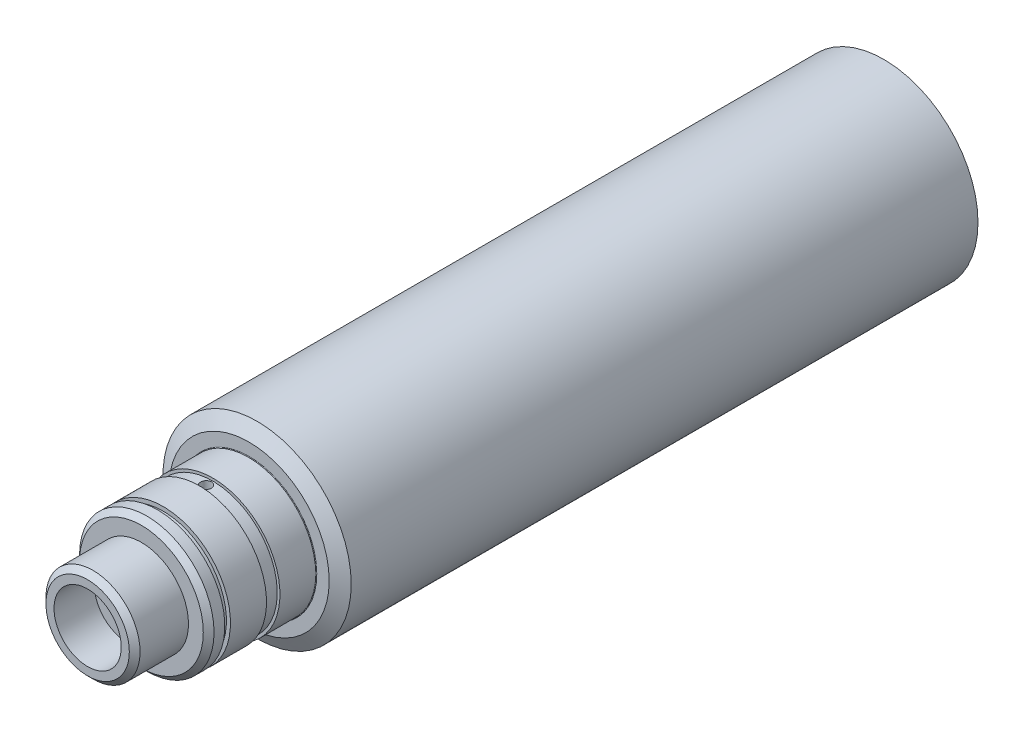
from build123d import *

# Parameters (mm, degrees)
ESQUISSE1_R             = 35
EXTRUSION1_DEPTH        = 236
CHANFREIN1_SIZE         = 3
CHANFREIN1_SIZE2        = 5.196152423
CHANFREIN2_SIZE         = 2
D_GAGEMENT_M3_51_D      = 4
D_GAGEMENT_M3_51_DEPTH  = 35
D_GAGEMENT_M3_51_TIP    = 1.201721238
ESQUISSE12_W            = 1.5
ESQUISSE12_H            = 2.1
ESQUISSE13_R            = 17.5
EXTRUSION2_DEPTH        = 20
ESQUISSE19_R            = 12.5
ENL_V_MAT_EXTRU_1_DEPTH = 15
TROU_TARAUD_M82_D       = 6.8
TROU_TARAUD_M82_DEPTH   = 16
TROU_TARAUD_M82_TIP     = 2.042926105
TROU_TARAUD_M83_D       = 6.8
TROU_TARAUD_M83_DEPTH   = 16
TROU_TARAUD_M83_TIP     = 2.042926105
ESQUISSE27_R            = 3.4
ENL_V_MAT_EXTRU_3_DEPTH = 286.326129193
CONG_1_R                = 0.2
CHANFREIN3_SIZE         = 2


with BuildPart() as part:
    # Esquisse1 → Extrusion1 (new body)
    with BuildSketch(Plane.XY):
        Circle(ESQUISSE1_R)
    extrude(amount=EXTRUSION1_DEPTH)

    # Chanfrein1
    chanfrein1_edges = [part.edges().sort_by_distance(p)[0] for p in [
        (-35, 0, 236),
    ]]
    chanfrein1_side = [part.faces().sort_by_distance(p)[0] for p in [
        (-35, 0, 118),
    ]]
    chamfer(chanfrein1_edges, length=CHANFREIN1_SIZE, length2=CHANFREIN1_SIZE2, reference=chanfrein1_side[0])

    # Esquisse2 → R_volution1 (revolve)
    with BuildSketch(Plane(origin=(0, 0, 0), x_dir=(0, 0, -1), z_dir=(1, 0, 0)), mode=Mode.PRIVATE) as r_volution1_sk:
        Polygon((-236, 25), (-249.5, 25), (-249.5, 24), (-254.5, 24), (-254.5, 25), (-276, 25), (-276, 0), (-236, 0), align=None)
    revolve(r_volution1_sk.sketch.rotate(Axis((0, 0, 187.852900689), (0, 0, 1)), 90), axis=Axis((0, 0, 187.852900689), (0, 0, 1)))

    # Chanfrein2
    chanfrein2_edges = [part.edges().sort_by_distance(p)[0] for p in [
        (25, 0, 276),
    ]]
    chamfer(chanfrein2_edges, length=CHANFREIN2_SIZE)

    # D_gagement M3.51
    with Locations(Plane(origin=(0, 35, 0), x_dir=(-1, 0, 0), z_dir=(0, 1, 0))):
        with Locations((0, 252)):
            Hole(D_GAGEMENT_M3_51_D / 2, depth=D_GAGEMENT_M3_51_DEPTH)
            with Locations((0, 0, -(D_GAGEMENT_M3_51_DEPTH + D_GAGEMENT_M3_51_TIP / 2))):  # 118° drill point
                Cone(0, D_GAGEMENT_M3_51_D / 2, D_GAGEMENT_M3_51_TIP, mode=Mode.SUBTRACT)

    # Esquisse12 → Enl_vement de mati_re-R_volution1 (revolve, cut)
    with BuildSketch(Plane(origin=(0, 0, 0), x_dir=(1, 0, 0), z_dir=(0, 1, 0)), mode=Mode.PRIVATE) as enl_vement_de_mati_re_r_volution1_sk:
        with Locations((24.25, -268.95)):
            Rectangle(ESQUISSE12_W, ESQUISSE12_H)
    revolve(enl_vement_de_mati_re_r_volution1_sk.sketch.rotate(Axis((0, 0, 187.852900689), (0, 0, 1)), 180), axis=Axis((0, 0, 187.852900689), (0, 0, 1)), mode=Mode.SUBTRACT)

    # Esquisse13 → Extrusion2 (add)
    with BuildSketch(Plane.XY.offset(276)):
        Circle(ESQUISSE13_R)
    extrude(amount=EXTRUSION2_DEPTH)

    # Esquisse19 → Enl_v. mat.-Extru.1 (cut)
    with BuildSketch(Plane.XY.offset(296)):
        Circle(ESQUISSE19_R)
    extrude(amount=-ENL_V_MAT_EXTRU_1_DEPTH, mode=Mode.SUBTRACT)

    # Trou taraud_ M82
    with Locations(Plane.XY.offset(281)):
        with Locations((0, 0)):
            Hole(TROU_TARAUD_M82_D / 2, depth=TROU_TARAUD_M82_DEPTH)
            with Locations((0, 0, -(TROU_TARAUD_M82_DEPTH + TROU_TARAUD_M82_TIP / 2))):  # 118° drill point
                Cone(0, TROU_TARAUD_M82_D / 2, TROU_TARAUD_M82_TIP, mode=Mode.SUBTRACT)

    # Trou taraud_ M83
    with Locations(Plane(origin=(0, 0, 0), x_dir=(-1, 0, 0), z_dir=(0, 0, -1))):
        with Locations((0, 0)):
            Hole(TROU_TARAUD_M83_D / 2, depth=TROU_TARAUD_M83_DEPTH)
            with Locations((0, 0, -(TROU_TARAUD_M83_DEPTH + TROU_TARAUD_M83_TIP / 2))):  # 118° drill point
                Cone(0, TROU_TARAUD_M83_D / 2, TROU_TARAUD_M83_TIP, mode=Mode.SUBTRACT)

    # Esquisse27 → Enl_v. mat.-Extru.3 (cut, through all)
    with BuildSketch(Plane.XY.offset(281)):
        Circle(ESQUISSE27_R)
    extrude(amount=-ENL_V_MAT_EXTRU_3_DEPTH, mode=Mode.SUBTRACT)

    # Cong_1
    cong_1_edges = [part.edges().sort_by_distance(p)[0] for p in [
        (25, 0, 236),
    ]]
    fillet(cong_1_edges, radius=CONG_1_R)

    # Chanfrein3
    chanfrein3_edges = [part.edges().sort_by_distance(p)[0] for p in [
        (-17.5, 0, 296),
    ]]
    chamfer(chanfrein3_edges, length=CHANFREIN3_SIZE)


solid = part.part
